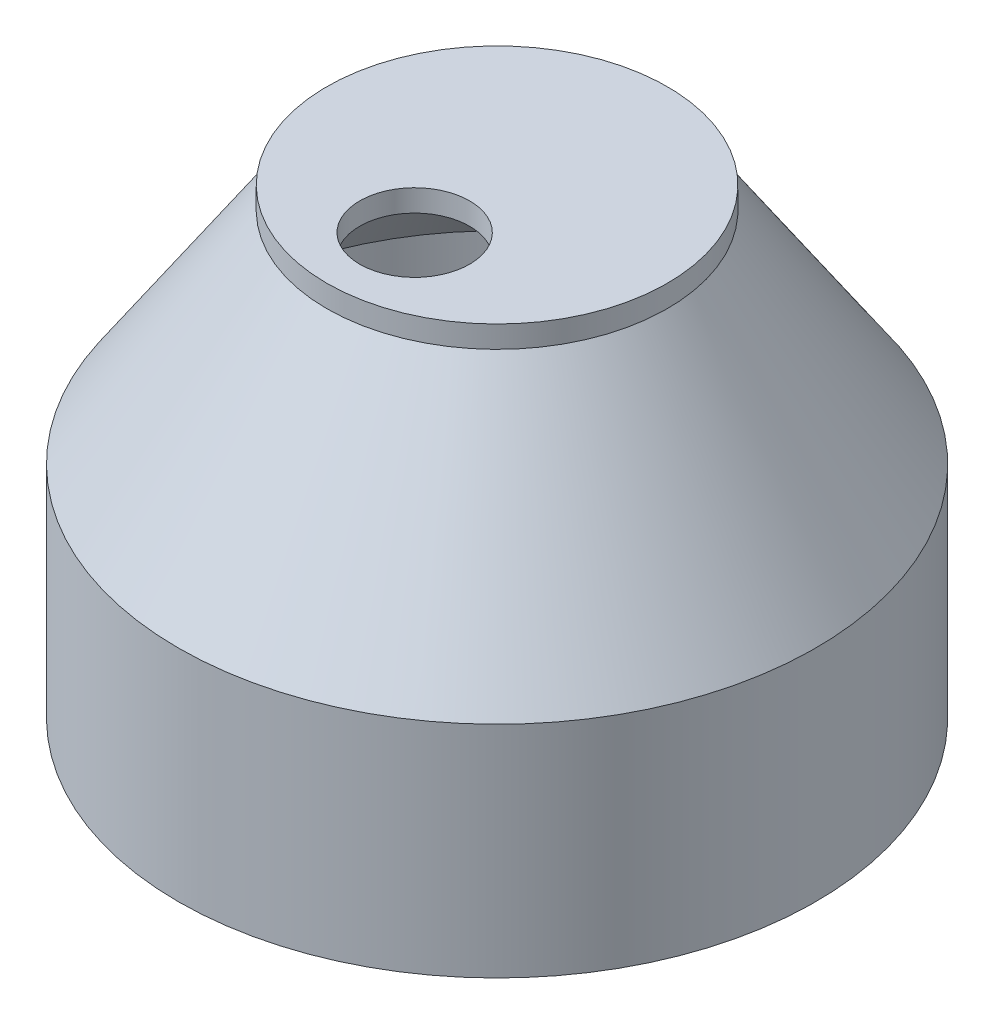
from build123d import *

# Parameters (mm, degrees)
IZIM6_R                     = 15.5
IZIM6_R_2                   = 5
Y_KSEKLIK_EKSTR_ZYON2_DEPTH = 2


with BuildPart() as part:
    # izim5 → D_nd_r1 (revolve)
    with BuildSketch(Plane(origin=(0, 0, 0), x_dir=(0, 0, -1), z_dir=(1, 0, 0)), mode=Mode.PRIVATE) as d_nd_r1_sk:
        Polygon((12.5, 20), (15.5, 20), (29, 0), (29, -20), (26, -20), (26, 0), align=None)
    revolve(d_nd_r1_sk.sketch.rotate(Axis((0, 40.284256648, 0), (0, -1, 0)), 180), axis=Axis((0, 40.284256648, 0), (0, -1, 0)))

    # izim6 → Y_kseklik-Ekstr_zyon2 (add)
    with BuildSketch(Plane(origin=(0, 20, 0), x_dir=(1, 0, 0), z_dir=(0, 1, 0))):
        with Locations(Location((0, 0, 0), (0, 0, 270))):
            Circle(IZIM6_R)
        with Locations(Location((0, -7.5, 0), (0, 0, 270))):
            Circle(IZIM6_R_2, mode=Mode.SUBTRACT)
    extrude(amount=Y_KSEKLIK_EKSTR_ZYON2_DEPTH)


solid = part.part
